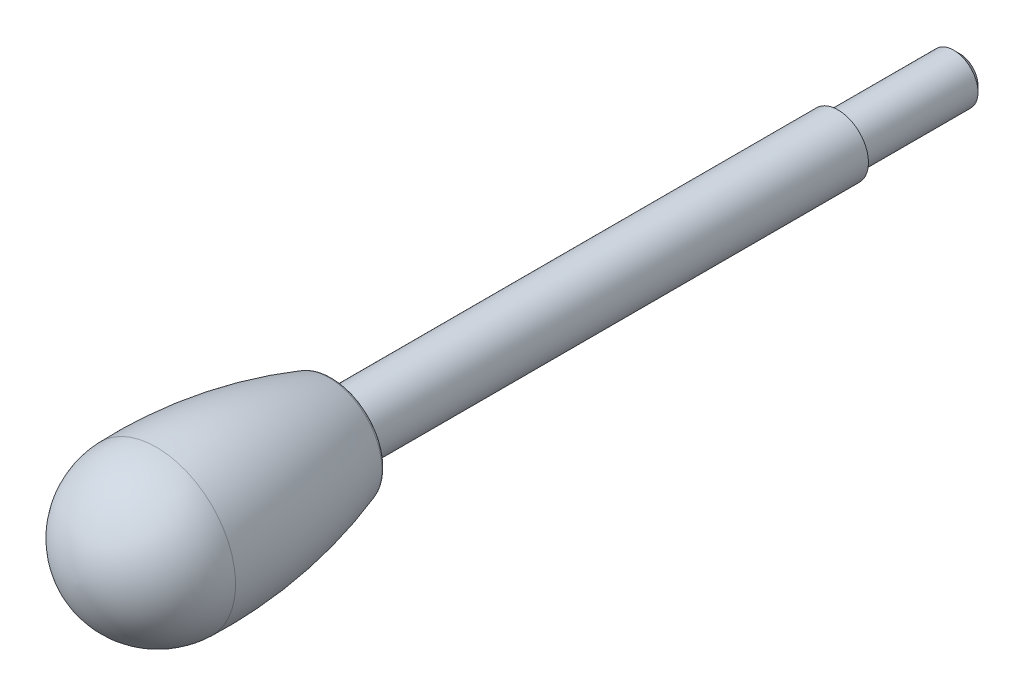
ISO-10303-21;
HEADER;
FILE_DESCRIPTION(('STEP AP214'),'2;1');
FILE_NAME('part.step','',(''),(''),'','','');
FILE_SCHEMA(('AUTOMOTIVE_DESIGN { 1 0 10303 214 1 1 1 1 }'));
ENDSEC;
DATA;
#1=APPLICATION_CONTEXT('core data for automotive mechanical design processes');
#2=APPLICATION_PROTOCOL_DEFINITION('international standard','automotive_design',2000,#1);
#3=PRODUCT_CONTEXT('',#1,'mechanical');
#4=PRODUCT('Part','Part','',(#3));
#5=PRODUCT_RELATED_PRODUCT_CATEGORY('part','',(#4));
#6=PRODUCT_DEFINITION_FORMATION('','',#4);
#7=PRODUCT_DEFINITION_CONTEXT('part definition',#1,'design');
#8=PRODUCT_DEFINITION('design','',#6,#7);
#9=PRODUCT_DEFINITION_SHAPE('','',#8);
#10=(LENGTH_UNIT() NAMED_UNIT(*) SI_UNIT(.MILLI.,.METRE.));
#11=(NAMED_UNIT(*) PLANE_ANGLE_UNIT() SI_UNIT($,.RADIAN.));
#12=(NAMED_UNIT(*) SI_UNIT($,.STERADIAN.) SOLID_ANGLE_UNIT());
#13=UNCERTAINTY_MEASURE_WITH_UNIT(LENGTH_MEASURE(1.E-05),#10,'distance_accuracy_value','');
#14=(GEOMETRIC_REPRESENTATION_CONTEXT(3) GLOBAL_UNCERTAINTY_ASSIGNED_CONTEXT((#13)) GLOBAL_UNIT_ASSIGNED_CONTEXT((#10,
#11,#12)) REPRESENTATION_CONTEXT('',''));
#15=CARTESIAN_POINT('',(0.,0.,0.));
#16=DIRECTION('',(0.,0.,1.));
#17=DIRECTION('',(1.,0.,0.));
#18=AXIS2_PLACEMENT_3D('',#15,#16,#17);
#19=CARTESIAN_POINT('',(0.,5.,0.));
#20=DIRECTION('',(0.,0.,1.));
#21=DIRECTION('',(1.,0.,0.));
#22=AXIS2_PLACEMENT_3D('',#19,#20,#21);
#23=PLANE('',#22);
#24=CARTESIAN_POINT('',(0.,0.,0.));
#25=DIRECTION('',(0.,0.,-1.));
#26=DIRECTION('',(-1.,0.,0.));
#27=AXIS2_PLACEMENT_3D('',#24,#25,#26);
#28=CIRCLE('',#27,4.);
#29=CARTESIAN_POINT('',(-4.,0.,0.));
#30=VERTEX_POINT('',#29);
#31=EDGE_CURVE('E78',#30,#30,#28,.T.);
#32=ORIENTED_EDGE('',*,*,#31,.F.);
#33=EDGE_LOOP('',(#32));
#34=FACE_BOUND('',#33,.T.);
#35=CARTESIAN_POINT('',(0.,0.,0.));
#36=DIRECTION('',(0.,0.,-1.));
#37=DIRECTION('',(-1.,0.,0.));
#38=AXIS2_PLACEMENT_3D('',#35,#36,#37);
#39=CIRCLE('',#38,5.);
#40=CARTESIAN_POINT('',(-5.,0.,0.));
#41=VERTEX_POINT('',#40);
#42=EDGE_CURVE('E9',#41,#41,#39,.T.);
#43=ORIENTED_EDGE('',*,*,#42,.T.);
#44=EDGE_LOOP('',(#43));
#45=FACE_BOUND('',#44,.T.);
#46=ADVANCED_FACE('F14',(#34,#45),#23,.F.);
#47=CARTESIAN_POINT('',(0.,0.,-32.7199223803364));
#48=DIRECTION('',(0.,0.,-1.));
#49=DIRECTION('',(-1.,0.,0.));
#50=AXIS2_PLACEMENT_3D('',#47,#48,#49);
#51=CYLINDRICAL_SURFACE('',#50,5.);
#52=ORIENTED_EDGE('',*,*,#42,.F.);
#53=EDGE_LOOP('',(#52));
#54=FACE_BOUND('',#53,.T.);
#55=CARTESIAN_POINT('',(0.,0.,83.));
#56=DIRECTION('',(0.,0.,-1.));
#57=DIRECTION('',(-1.,0.,0.));
#58=AXIS2_PLACEMENT_3D('',#55,#56,#57);
#59=CIRCLE('',#58,5.);
#60=CARTESIAN_POINT('',(-5.,0.,83.));
#61=VERTEX_POINT('',#60);
#62=EDGE_CURVE('E20',#61,#61,#59,.T.);
#63=ORIENTED_EDGE('',*,*,#62,.T.);
#64=EDGE_LOOP('',(#63));
#65=FACE_BOUND('',#64,.T.);
#66=ADVANCED_FACE('F48',(#54,#65),#51,.T.);
#67=CARTESIAN_POINT('',(0.,7.78846659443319,83.));
#68=DIRECTION('',(0.,0.,1.));
#69=DIRECTION('',(1.,0.,0.));
#70=AXIS2_PLACEMENT_3D('',#67,#68,#69);
#71=PLANE('',#70);
#72=ORIENTED_EDGE('',*,*,#62,.F.);
#73=EDGE_LOOP('',(#72));
#74=FACE_BOUND('',#73,.T.);
#75=CARTESIAN_POINT('',(0.,0.,83.));
#76=DIRECTION('',(0.,0.,-1.));
#77=DIRECTION('',(-1.,0.,0.));
#78=AXIS2_PLACEMENT_3D('',#75,#76,#77);
#79=CIRCLE('',#78,7.78846659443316);
#80=CARTESIAN_POINT('',(-7.78846659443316,0.,83.));
#81=VERTEX_POINT('',#80);
#82=EDGE_CURVE('E37',#81,#81,#79,.T.);
#83=ORIENTED_EDGE('',*,*,#82,.T.);
#84=EDGE_LOOP('',(#83));
#85=FACE_BOUND('',#84,.T.);
#86=ADVANCED_FACE('F50',(#74,#85),#71,.F.);
#87=CARTESIAN_POINT('',(0.,0.,84.));
#88=DIRECTION('',(0.,0.,-1.));
#89=DIRECTION('',(-1.,0.,0.));
#90=AXIS2_PLACEMENT_3D('',#87,#88,#89);
#91=TOROIDAL_SURFACE('',#90,7.78846659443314,0.999999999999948);
#92=ORIENTED_EDGE('',*,*,#82,.F.);
#93=EDGE_LOOP('',(#92));
#94=FACE_BOUND('',#93,.T.);
#95=CARTESIAN_POINT('',(0.,0.,83.6764699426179));
#96=DIRECTION('',(0.,0.,-1.));
#97=DIRECTION('',(-1.,0.,0.));
#98=AXIS2_PLACEMENT_3D('',#95,#96,#97);
#99=CIRCLE('',#98,8.73468448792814);
#100=CARTESIAN_POINT('',(-8.73468448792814,0.,83.6764699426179));
#101=VERTEX_POINT('',#100);
#102=EDGE_CURVE('E33',#101,#101,#99,.T.);
#103=ORIENTED_EDGE('',*,*,#102,.T.);
#104=EDGE_LOOP('',(#103));
#105=FACE_BOUND('',#104,.T.);
#106=ADVANCED_FACE('F53',(#94,#105),#91,.T.);
#107=CARTESIAN_POINT('',(0.,0.,109.558874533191));
#108=DIRECTION('',(0.,0.,-1.));
#109=DIRECTION('',(-1.,0.,0.));
#110=AXIS2_PLACEMENT_3D('',#107,#108,#109);
#111=DEGENERATE_TOROIDAL_SURFACE('',#110,66.9627469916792,80.,.F.);
#112=ORIENTED_EDGE('',*,*,#102,.F.);
#113=EDGE_LOOP('',(#112));
#114=FACE_BOUND('',#113,.T.);
#115=CARTESIAN_POINT('',(0.,0.,112.));
#116=DIRECTION('',(0.,0.,-1.));
#117=DIRECTION('',(-1.,0.,0.));
#118=AXIS2_PLACEMENT_3D('',#115,#116,#117);
#119=CIRCLE('',#118,13.);
#120=CARTESIAN_POINT('',(-13.,0.,112.));
#121=VERTEX_POINT('',#120);
#122=EDGE_CURVE('E31',#121,#121,#119,.T.);
#123=ORIENTED_EDGE('',*,*,#122,.T.);
#124=EDGE_LOOP('',(#123));
#125=FACE_BOUND('',#124,.T.);
#126=ADVANCED_FACE('F27',(#114,#125),#111,.F.);
#127=CARTESIAN_POINT('',(0.409364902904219,0.,111.590635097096));
#128=DIRECTION('',(0.,-1.,0.));
#129=DIRECTION('',(-1.,0.,0.));
#130=AXIS2_PLACEMENT_3D('',#127,#128,#129);
#131=CIRCLE('',#130,13.4156120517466);
#132=TRIMMED_CURVE('',#131,(PARAMETER_VALUE(-1.54027752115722)),
(PARAMETER_VALUE(1.54027752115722)),.T.,.PARAMETER.);
#133=CARTESIAN_POINT('',(0.,0.,111.590635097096));
#134=DIRECTION('',(0.,0.,-1.));
#135=AXIS1_PLACEMENT('',#133,#134);
#136=SURFACE_OF_REVOLUTION('',#132,#135);
#137=CARTESIAN_POINT('',(0.,0.,125.));
#138=VERTEX_POINT('',#137);
#139=VERTEX_LOOP('',#138);
#140=FACE_BOUND('',#139,.T.);
#141=ORIENTED_EDGE('',*,*,#122,.F.);
#142=EDGE_LOOP('',(#141));
#143=FACE_BOUND('',#142,.T.);
#144=ADVANCED_FACE('F23',(#140,#143),#136,.T.);
#145=CARTESIAN_POINT('',(0.,3.,-20.));
#146=DIRECTION('',(0.,0.,1.));
#147=DIRECTION('',(1.,0.,0.));
#148=AXIS2_PLACEMENT_3D('',#145,#146,#147);
#149=PLANE('',#148);
#150=CARTESIAN_POINT('',(0.,0.,-20.));
#151=DIRECTION('',(0.,0.,-1.));
#152=DIRECTION('',(-1.,0.,0.));
#153=AXIS2_PLACEMENT_3D('',#150,#151,#152);
#154=CIRCLE('',#153,3.);
#155=CARTESIAN_POINT('',(-3.,0.,-20.));
#156=VERTEX_POINT('',#155);
#157=EDGE_CURVE('E34',#156,#156,#154,.T.);
#158=ORIENTED_EDGE('',*,*,#157,.T.);
#159=EDGE_LOOP('',(#158));
#160=FACE_BOUND('',#159,.T.);
#161=ADVANCED_FACE('F26',(#160),#149,.F.);
#162=CARTESIAN_POINT('',(0.,0.,-19.));
#163=DIRECTION('',(0.,0.,1.));
#164=DIRECTION('',(1.,0.,0.));
#165=AXIS2_PLACEMENT_3D('',#162,#163,#164);
#166=CONICAL_SURFACE('',#165,4.,0.785398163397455);
#167=ORIENTED_EDGE('',*,*,#157,.F.);
#168=EDGE_LOOP('',(#167));
#169=FACE_BOUND('',#168,.T.);
#170=CARTESIAN_POINT('',(0.,0.,-19.));
#171=DIRECTION('',(0.,0.,-1.));
#172=DIRECTION('',(-1.,0.,0.));
#173=AXIS2_PLACEMENT_3D('',#170,#171,#172);
#174=CIRCLE('',#173,4.);
#175=CARTESIAN_POINT('',(-4.,0.,-19.));
#176=VERTEX_POINT('',#175);
#177=EDGE_CURVE('E40',#176,#176,#174,.T.);
#178=ORIENTED_EDGE('',*,*,#177,.T.);
#179=EDGE_LOOP('',(#178));
#180=FACE_BOUND('',#179,.T.);
#181=ADVANCED_FACE('F85',(#169,#180),#166,.T.);
#182=CARTESIAN_POINT('',(0.,0.,-32.7199223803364));
#183=DIRECTION('',(0.,0.,-1.));
#184=DIRECTION('',(-1.,0.,0.));
#185=AXIS2_PLACEMENT_3D('',#182,#183,#184);
#186=CYLINDRICAL_SURFACE('',#185,4.);
#187=ORIENTED_EDGE('',*,*,#177,.F.);
#188=EDGE_LOOP('',(#187));
#189=FACE_BOUND('',#188,.T.);
#190=ORIENTED_EDGE('',*,*,#31,.T.);
#191=EDGE_LOOP('',(#190));
#192=FACE_BOUND('',#191,.T.);
#193=ADVANCED_FACE('F87',(#189,#192),#186,.T.);
#194=CLOSED_SHELL('',(#46,#66,#86,#106,#126,#144,#161,#181,#193));
#195=MANIFOLD_SOLID_BREP('B1',#194);
#196=ADVANCED_BREP_SHAPE_REPRESENTATION('',(#18,#195),#14);
#197=SHAPE_DEFINITION_REPRESENTATION(#9,#196);
ENDSEC;
END-ISO-10303-21;
